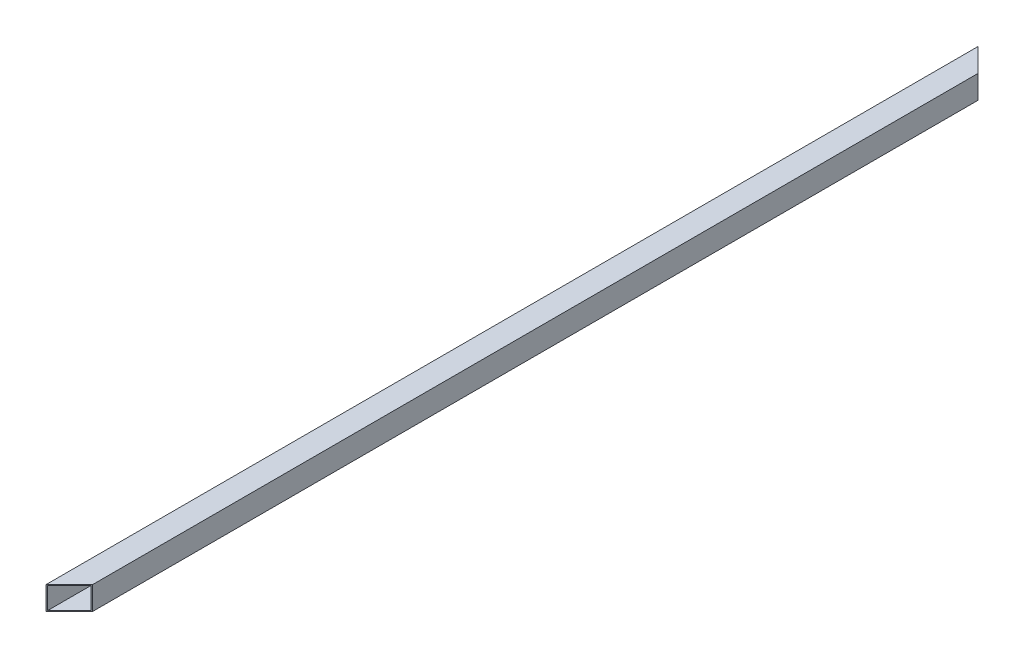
from build123d import *

# Parameters (mm, degrees)
SCHIZZO1_W                = 30
SCHIZZO1_H                = 30
SCHIZZO1_W_2              = 28
SCHIZZO1_H_2              = 28
ESTRUSIONE_SOTTILE1_DEPTH = 1200
TAGLIO_ESTRUSIONE1_REACH  = 1202.469


with BuildPart() as part:
    # Schizzo1 → Estrusione-Sottile1 (new body)
    with BuildSketch(Plane.XY):
        Rectangle(SCHIZZO1_W, SCHIZZO1_H)
        Rectangle(SCHIZZO1_W_2, SCHIZZO1_H_2, mode=Mode.SUBTRACT)
    extrude(amount=ESTRUSIONE_SOTTILE1_DEPTH)

    # Schizzo2 → Taglio-Estrusione1 (cut, up to next)
    with BuildSketch(Plane(origin=(0, 15, 0), x_dir=(1, 0, 0), z_dir=(0, 1, 0)), mode=Mode.PRIVATE) as taglio_estrusione1_sk1:
        Polygon((-15, 0), (15, -30), (15, 0), align=None)
    taglio_estrusione1_tool1 = extrude(taglio_estrusione1_sk1.sketch, amount=-TAGLIO_ESTRUSIONE1_REACH, mode=Mode.PRIVATE) & part.part
    taglio_estrusione1 = taglio_estrusione1_tool1.solids().sort_by_distance((5, 15, 10))[0]
    add(taglio_estrusione1, mode=Mode.SUBTRACT)

    # Specchia1: Taglio-Estrusione1 across plane
    add(taglio_estrusione1.mirror(Plane(origin=(0, 0, 600), x_dir=(1, 0, 0), z_dir=(0, 0, -1))), mode=Mode.SUBTRACT)


solid = part.part
